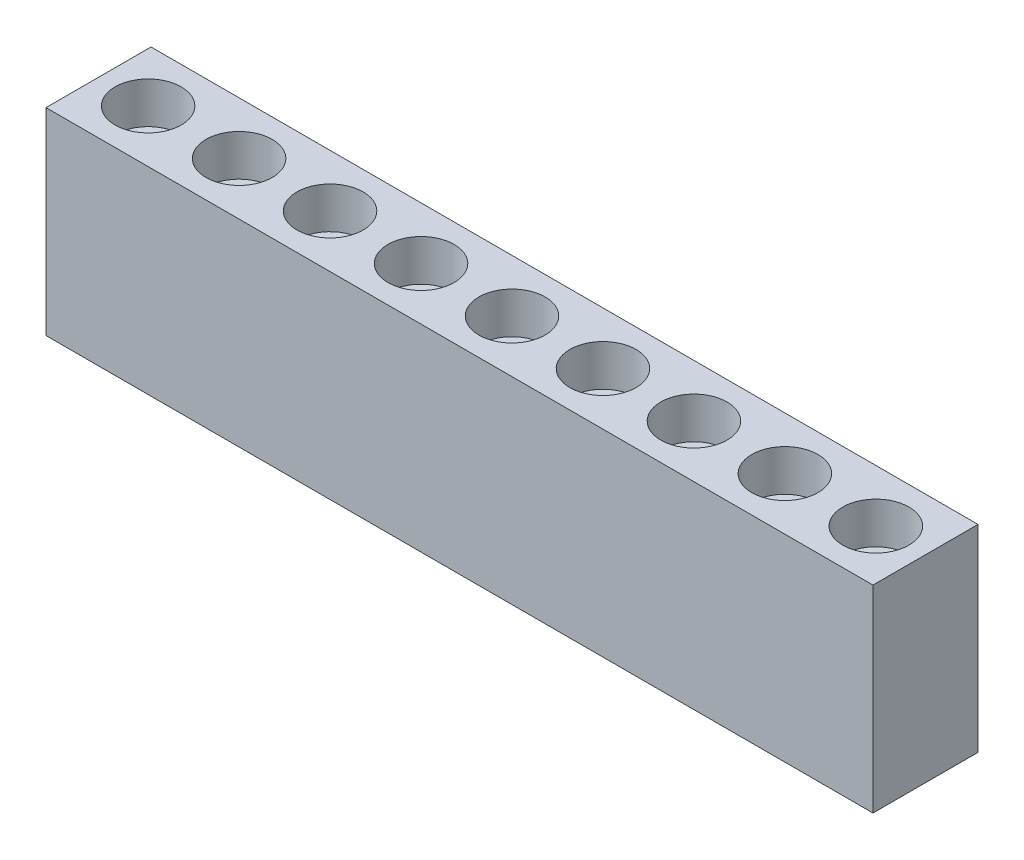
from build123d import *

# Parameters (mm, degrees)
SKETCH1_W           = 200
SKETCH1_H           = 47.75
BOSS_EXTRUDE1_DEPTH = 12.7
SKETCH6_R           = 8
CUT_EXTRUDE4_DEPTH  = 10
SKETCH7_R           = 4
CUT_EXTRUDE5_DEPTH  = 37.75
LPATTERN1_COUNT     = 9
LPATTERN1_PITCH     = 22


with BuildPart() as part:
    # Sketch1 → Boss-Extrude1 (new, symmetric)
    with BuildSketch(Plane.XY):
        Rectangle(SKETCH1_W, SKETCH1_H)
    extrude(amount=BOSS_EXTRUDE1_DEPTH, both=True)

    # Sketch6 → Cut-Extrude4 (cut)
    with BuildSketch(Plane(origin=(0, 23.875, 0), x_dir=(1, 0, 0), z_dir=(0, 1, 0))):
        with Locations(Location((-88, 0, 0), (0, 0, 180))):
            Circle(SKETCH6_R)
    cut_extrude4 = extrude(amount=-CUT_EXTRUDE4_DEPTH, mode=Mode.SUBTRACT)

    # Sketch7 → Cut-Extrude5 (cut)
    with BuildSketch(Plane(origin=(0, 13.875, 0), x_dir=(1, 0, 0), z_dir=(0, 1, 0))):
        with Locations(Location((-88, 0, 0), (0, 0, 180))):
            Circle(SKETCH7_R)
    cut_extrude5 = extrude(amount=-CUT_EXTRUDE5_DEPTH, mode=Mode.SUBTRACT)

    # LPattern1: Cut-Extrude4, Cut-Extrude5 ×9
    with Locations(*[(i * LPATTERN1_PITCH, 0, 0) for i in range(1, LPATTERN1_COUNT)]):
        add(cut_extrude4, mode=Mode.SUBTRACT)
        add(cut_extrude5, mode=Mode.SUBTRACT)


solid = part.part
